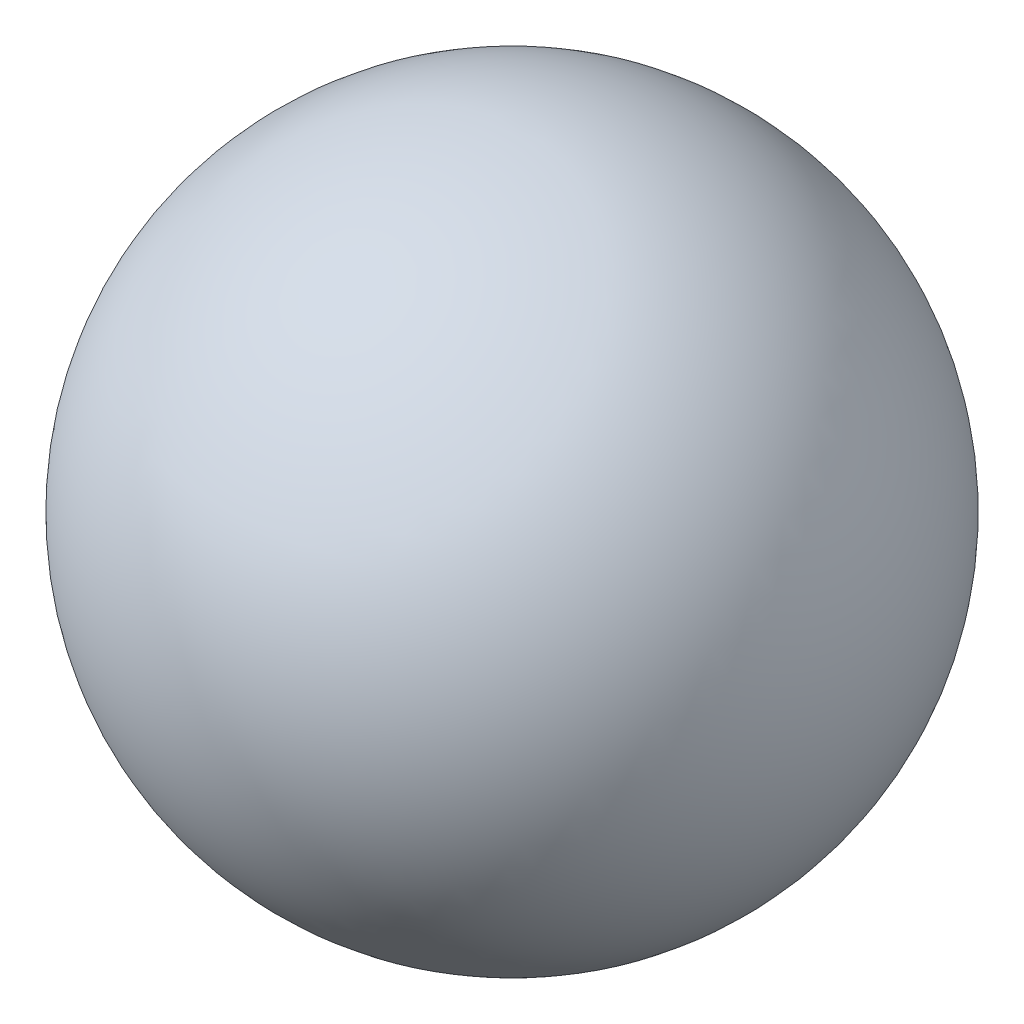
from build123d import *


with BuildPart() as part:
    # Skizze1 → Rotation-D_nn3 (revolve)
    with BuildSketch(Plane.XY):
        with BuildLine():
            ThreePointArc((0, 13.2442249), (20, -6.7557751), (0, -26.7557751))
            Line((0, -26.7557751), (0, -16.7557751))
            ThreePointArc((0, -16.7557751), (10, -6.7557751), (0, 3.2442249))
            Line((0, 3.2442249), (0, 13.2442249))
        make_face()
    revolve(axis=Axis((0, 13.2442249, 0), (0, -1, 0)))


solid = part.part
